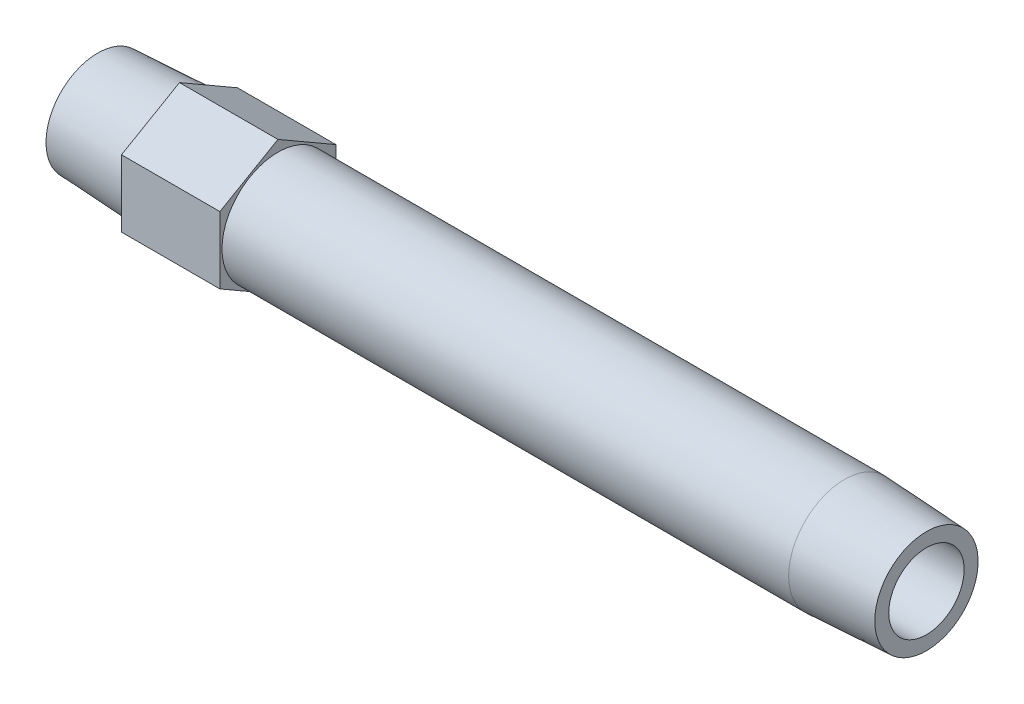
ISO-10303-21;
HEADER;
FILE_DESCRIPTION(('STEP AP214'),'2;1');
FILE_NAME('part.step','',(''),(''),'','','');
FILE_SCHEMA(('AUTOMOTIVE_DESIGN { 1 0 10303 214 1 1 1 1 }'));
ENDSEC;
DATA;
#1=APPLICATION_CONTEXT('core data for automotive mechanical design processes');
#2=APPLICATION_PROTOCOL_DEFINITION('international standard','automotive_design',2000,#1);
#3=PRODUCT_CONTEXT('',#1,'mechanical');
#4=PRODUCT('Part','Part','',(#3));
#5=PRODUCT_RELATED_PRODUCT_CATEGORY('part','',(#4));
#6=PRODUCT_DEFINITION_FORMATION('','',#4);
#7=PRODUCT_DEFINITION_CONTEXT('part definition',#1,'design');
#8=PRODUCT_DEFINITION('design','',#6,#7);
#9=PRODUCT_DEFINITION_SHAPE('','',#8);
#10=(LENGTH_UNIT() NAMED_UNIT(*) SI_UNIT(.MILLI.,.METRE.));
#11=(NAMED_UNIT(*) PLANE_ANGLE_UNIT() SI_UNIT($,.RADIAN.));
#12=(NAMED_UNIT(*) SI_UNIT($,.STERADIAN.) SOLID_ANGLE_UNIT());
#13=UNCERTAINTY_MEASURE_WITH_UNIT(LENGTH_MEASURE(1.E-05),#10,'distance_accuracy_value','');
#14=(GEOMETRIC_REPRESENTATION_CONTEXT(3) GLOBAL_UNCERTAINTY_ASSIGNED_CONTEXT((#13)) GLOBAL_UNIT_ASSIGNED_CONTEXT((#10,
#11,#12)) REPRESENTATION_CONTEXT('',''));
#15=CARTESIAN_POINT('',(0.,0.,0.));
#16=DIRECTION('',(0.,0.,1.));
#17=DIRECTION('',(1.,0.,0.));
#18=AXIS2_PLACEMENT_3D('',#15,#16,#17);
#19=CARTESIAN_POINT('',(0.,0.,-6.3321927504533));
#20=DIRECTION('',(1.,0.,0.));
#21=DIRECTION('',(0.,0.,-1.));
#22=AXIS2_PLACEMENT_3D('',#19,#20,#21);
#23=PLANE('',#22);
#24=CARTESIAN_POINT('',(0.,0.,0.));
#25=DIRECTION('',(-1.,0.,0.));
#26=DIRECTION('',(0.,0.,1.));
#27=AXIS2_PLACEMENT_3D('',#24,#25,#26);
#28=CIRCLE('',#27,6.3321927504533);
#29=CARTESIAN_POINT('',(0.,0.,6.3321927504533));
#30=VERTEX_POINT('',#29);
#31=EDGE_CURVE('E147',#30,#30,#28,.T.);
#32=ORIENTED_EDGE('',*,*,#31,.T.);
#33=EDGE_LOOP('',(#32));
#34=FACE_BOUND('',#33,.T.);
#35=CARTESIAN_POINT('',(0.,0.,0.));
#36=DIRECTION('',(1.,0.,0.));
#37=DIRECTION('',(0.,0.,1.));
#38=AXIS2_PLACEMENT_3D('',#35,#36,#37);
#39=CIRCLE('',#38,4.6228);
#40=CARTESIAN_POINT('',(0.,0.,4.6228));
#41=VERTEX_POINT('',#40);
#42=EDGE_CURVE('E159',#41,#41,#39,.T.);
#43=ORIENTED_EDGE('',*,*,#42,.T.);
#44=EDGE_LOOP('',(#43));
#45=FACE_BOUND('',#44,.T.);
#46=ADVANCED_FACE('F15',(#34,#45),#23,.F.);
#47=CARTESIAN_POINT('',(101.6,0.,-6.33219275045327));
#48=DIRECTION('',(-1.,0.,0.));
#49=DIRECTION('',(0.,0.,1.));
#50=AXIS2_PLACEMENT_3D('',#47,#48,#49);
#51=PLANE('',#50);
#52=CARTESIAN_POINT('',(101.6,0.,0.));
#53=DIRECTION('',(-1.,0.,0.));
#54=DIRECTION('',(0.,0.,1.));
#55=AXIS2_PLACEMENT_3D('',#52,#53,#54);
#56=CIRCLE('',#55,6.33219275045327);
#57=CARTESIAN_POINT('',(101.6,0.,6.33219275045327));
#58=VERTEX_POINT('',#57);
#59=EDGE_CURVE('E150',#58,#58,#56,.T.);
#60=ORIENTED_EDGE('',*,*,#59,.F.);
#61=EDGE_LOOP('',(#60));
#62=FACE_BOUND('',#61,.T.);
#63=CARTESIAN_POINT('',(101.6,0.,0.));
#64=DIRECTION('',(-1.,0.,0.));
#65=DIRECTION('',(0.,0.,1.));
#66=AXIS2_PLACEMENT_3D('',#63,#64,#65);
#67=CIRCLE('',#66,4.6228);
#68=CARTESIAN_POINT('',(101.6,0.,4.6228));
#69=VERTEX_POINT('',#68);
#70=EDGE_CURVE('E156',#69,#69,#67,.F.);
#71=ORIENTED_EDGE('',*,*,#70,.F.);
#72=EDGE_LOOP('',(#71));
#73=FACE_BOUND('',#72,.T.);
#74=ADVANCED_FACE('F178',(#62,#73),#51,.F.);
#75=CARTESIAN_POINT('',(22.098,-12.3183453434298,7.112));
#76=DIRECTION('',(-1.,0.,0.));
#77=DIRECTION('',(0.,-1.,0.));
#78=AXIS2_PLACEMENT_3D('',#75,#76,#77);
#79=PLANE('',#78);
#80=DIRECTION('',(0.,0.5,-0.866025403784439));
#81=VECTOR('',#80,1.);
#82=CARTESIAN_POINT('',(22.098,-8.21223022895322,0.));
#83=LINE('',#82,#81);
#84=CARTESIAN_POINT('',(22.098,-8.21223022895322,0.));
#85=VERTEX_POINT('',#84);
#86=CARTESIAN_POINT('',(22.098,-4.10611511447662,-7.112));
#87=VERTEX_POINT('',#86);
#88=EDGE_CURVE('E103',#85,#87,#83,.T.);
#89=ORIENTED_EDGE('',*,*,#88,.T.);
#90=DIRECTION('',(0.,1.,0.));
#91=VECTOR('',#90,1.);
#92=CARTESIAN_POINT('',(22.098,-4.10611511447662,-7.112));
#93=LINE('',#92,#91);
#94=CARTESIAN_POINT('',(22.098,4.10611511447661,-7.112));
#95=VERTEX_POINT('',#94);
#96=EDGE_CURVE('E83',#87,#95,#93,.T.);
#97=ORIENTED_EDGE('',*,*,#96,.T.);
#98=DIRECTION('',(0.,0.5,0.866025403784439));
#99=VECTOR('',#98,1.);
#100=CARTESIAN_POINT('',(22.098,4.10611511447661,-7.112));
#101=LINE('',#100,#99);
#102=CARTESIAN_POINT('',(22.098,8.21223022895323,0.));
#103=VERTEX_POINT('',#102);
#104=EDGE_CURVE('E102',#95,#103,#101,.T.);
#105=ORIENTED_EDGE('',*,*,#104,.T.);
#106=DIRECTION('',(0.,-0.5,0.866025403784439));
#107=VECTOR('',#106,1.);
#108=CARTESIAN_POINT('',(22.098,8.21223022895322,0.));
#109=LINE('',#108,#107);
#110=CARTESIAN_POINT('',(22.098,4.10611511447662,7.112));
#111=VERTEX_POINT('',#110);
#112=EDGE_CURVE('E105',#103,#111,#109,.T.);
#113=ORIENTED_EDGE('',*,*,#112,.T.);
#114=DIRECTION('',(0.,-1.,0.));
#115=VECTOR('',#114,1.);
#116=CARTESIAN_POINT('',(22.098,4.10611511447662,7.112));
#117=LINE('',#116,#115);
#118=CARTESIAN_POINT('',(22.098,-4.10611511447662,7.112));
#119=VERTEX_POINT('',#118);
#120=EDGE_CURVE('E35',#111,#119,#117,.T.);
#121=ORIENTED_EDGE('',*,*,#120,.T.);
#122=DIRECTION('',(0.,-0.5,-0.866025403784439));
#123=VECTOR('',#122,1.);
#124=CARTESIAN_POINT('',(22.098,-4.10611511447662,7.112));
#125=LINE('',#124,#123);
#126=EDGE_CURVE('E30',#119,#85,#125,.T.);
#127=ORIENTED_EDGE('',*,*,#126,.T.);
#128=EDGE_LOOP('',(#89,#97,#105,#113,#121,#127));
#129=FACE_BOUND('',#128,.T.);
#130=CARTESIAN_POINT('',(22.098,0.,0.));
#131=DIRECTION('',(-1.,0.,0.));
#132=DIRECTION('',(0.,-1.,0.));
#133=AXIS2_PLACEMENT_3D('',#130,#131,#132);
#134=CIRCLE('',#133,6.858);
#135=CARTESIAN_POINT('',(22.098,-6.858,0.));
#136=VERTEX_POINT('',#135);
#137=EDGE_CURVE('E89',#136,#136,#134,.F.);
#138=ORIENTED_EDGE('',*,*,#137,.F.);
#139=EDGE_LOOP('',(#138));
#140=FACE_BOUND('',#139,.T.);
#141=ADVANCED_FACE('F124',(#129,#140),#79,.F.);
#142=CARTESIAN_POINT('',(10.033,-12.3183453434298,7.112));
#143=DIRECTION('',(-1.,0.,0.));
#144=DIRECTION('',(0.,-1.,0.));
#145=AXIS2_PLACEMENT_3D('',#142,#143,#144);
#146=PLANE('',#145);
#147=DIRECTION('',(0.,0.5,-0.866025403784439));
#148=VECTOR('',#147,1.);
#149=CARTESIAN_POINT('',(10.033,-8.21223022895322,0.));
#150=LINE('',#149,#148);
#151=CARTESIAN_POINT('',(10.033,-8.21223022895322,0.));
#152=VERTEX_POINT('',#151);
#153=CARTESIAN_POINT('',(10.033,-4.10611511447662,-7.112));
#154=VERTEX_POINT('',#153);
#155=EDGE_CURVE('E73',#152,#154,#150,.T.);
#156=ORIENTED_EDGE('',*,*,#155,.F.);
#157=DIRECTION('',(0.,-0.5,-0.866025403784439));
#158=VECTOR('',#157,1.);
#159=CARTESIAN_POINT('',(10.033,-4.10611511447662,7.112));
#160=LINE('',#159,#158);
#161=CARTESIAN_POINT('',(10.033,-4.10611511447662,7.112));
#162=VERTEX_POINT('',#161);
#163=EDGE_CURVE('E99',#162,#152,#160,.T.);
#164=ORIENTED_EDGE('',*,*,#163,.F.);
#165=DIRECTION('',(0.,-1.,0.));
#166=VECTOR('',#165,1.);
#167=CARTESIAN_POINT('',(10.033,4.10611511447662,7.112));
#168=LINE('',#167,#166);
#169=CARTESIAN_POINT('',(10.033,4.10611511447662,7.112));
#170=VERTEX_POINT('',#169);
#171=EDGE_CURVE('E133',#170,#162,#168,.T.);
#172=ORIENTED_EDGE('',*,*,#171,.F.);
#173=DIRECTION('',(0.,-0.5,0.866025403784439));
#174=VECTOR('',#173,1.);
#175=CARTESIAN_POINT('',(10.033,8.21223022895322,0.));
#176=LINE('',#175,#174);
#177=CARTESIAN_POINT('',(10.033,8.21223022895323,0.));
#178=VERTEX_POINT('',#177);
#179=EDGE_CURVE('E129',#178,#170,#176,.T.);
#180=ORIENTED_EDGE('',*,*,#179,.F.);
#181=DIRECTION('',(0.,0.5,0.866025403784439));
#182=VECTOR('',#181,1.);
#183=CARTESIAN_POINT('',(10.033,4.10611511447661,-7.112));
#184=LINE('',#183,#182);
#185=CARTESIAN_POINT('',(10.033,4.10611511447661,-7.112));
#186=VERTEX_POINT('',#185);
#187=EDGE_CURVE('E75',#186,#178,#184,.T.);
#188=ORIENTED_EDGE('',*,*,#187,.F.);
#189=DIRECTION('',(0.,1.,0.));
#190=VECTOR('',#189,1.);
#191=CARTESIAN_POINT('',(10.033,-4.10611511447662,-7.112));
#192=LINE('',#191,#190);
#193=EDGE_CURVE('E68',#154,#186,#192,.T.);
#194=ORIENTED_EDGE('',*,*,#193,.F.);
#195=EDGE_LOOP('',(#156,#164,#172,#180,#188,#194));
#196=FACE_BOUND('',#195,.T.);
#197=CARTESIAN_POINT('',(10.033,0.,0.));
#198=DIRECTION('',(-1.,0.,0.));
#199=DIRECTION('',(0.,0.,1.));
#200=AXIS2_PLACEMENT_3D('',#197,#198,#199);
#201=CIRCLE('',#200,6.858);
#202=CARTESIAN_POINT('',(10.033,0.,6.858));
#203=VERTEX_POINT('',#202);
#204=EDGE_CURVE('E95',#203,#203,#201,.T.);
#205=ORIENTED_EDGE('',*,*,#204,.F.);
#206=EDGE_LOOP('',(#205));
#207=FACE_BOUND('',#206,.T.);
#208=ADVANCED_FACE('F69',(#196,#207),#146,.T.);
#209=CARTESIAN_POINT('',(22.098,-8.21223022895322,0.));
#210=DIRECTION('',(0.,0.866025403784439,0.5));
#211=DIRECTION('',(0.,-0.5,0.866025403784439));
#212=AXIS2_PLACEMENT_3D('',#209,#210,#211);
#213=PLANE('',#212);
#214=ORIENTED_EDGE('',*,*,#155,.T.);
#215=DIRECTION('',(-1.,0.,0.));
#216=VECTOR('',#215,1.);
#217=CARTESIAN_POINT('',(22.098,-4.10611511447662,-7.112));
#218=LINE('',#217,#216);
#219=EDGE_CURVE('E10',#87,#154,#218,.T.);
#220=ORIENTED_EDGE('',*,*,#219,.F.);
#221=ORIENTED_EDGE('',*,*,#88,.F.);
#222=DIRECTION('',(-1.,0.,0.));
#223=VECTOR('',#222,1.);
#224=CARTESIAN_POINT('',(22.098,-8.21223022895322,0.));
#225=LINE('',#224,#223);
#226=EDGE_CURVE('E87',#85,#152,#225,.T.);
#227=ORIENTED_EDGE('',*,*,#226,.T.);
#228=EDGE_LOOP('',(#214,#220,#221,#227));
#229=FACE_BOUND('',#228,.T.);
#230=ADVANCED_FACE('F17',(#229),#213,.F.);
#231=CARTESIAN_POINT('',(22.098,-4.10611511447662,-7.112));
#232=DIRECTION('',(0.,0.,1.));
#233=DIRECTION('',(0.,-1.,0.));
#234=AXIS2_PLACEMENT_3D('',#231,#232,#233);
#235=PLANE('',#234);
#236=ORIENTED_EDGE('',*,*,#193,.T.);
#237=DIRECTION('',(-1.,0.,0.));
#238=VECTOR('',#237,1.);
#239=CARTESIAN_POINT('',(22.098,4.10611511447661,-7.112));
#240=LINE('',#239,#238);
#241=EDGE_CURVE('E23',#95,#186,#240,.T.);
#242=ORIENTED_EDGE('',*,*,#241,.F.);
#243=ORIENTED_EDGE('',*,*,#96,.F.);
#244=ORIENTED_EDGE('',*,*,#219,.T.);
#245=EDGE_LOOP('',(#236,#242,#243,#244));
#246=FACE_BOUND('',#245,.T.);
#247=ADVANCED_FACE('F82',(#246),#235,.F.);
#248=CARTESIAN_POINT('',(22.098,4.10611511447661,-7.112));
#249=DIRECTION('',(0.,-0.866025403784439,0.5));
#250=DIRECTION('',(0.,-0.5,-0.866025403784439));
#251=AXIS2_PLACEMENT_3D('',#248,#249,#250);
#252=PLANE('',#251);
#253=ORIENTED_EDGE('',*,*,#187,.T.);
#254=DIRECTION('',(-1.,0.,0.));
#255=VECTOR('',#254,1.);
#256=CARTESIAN_POINT('',(22.098,8.21223022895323,0.));
#257=LINE('',#256,#255);
#258=EDGE_CURVE('E117',#103,#178,#257,.T.);
#259=ORIENTED_EDGE('',*,*,#258,.F.);
#260=ORIENTED_EDGE('',*,*,#104,.F.);
#261=ORIENTED_EDGE('',*,*,#241,.T.);
#262=EDGE_LOOP('',(#253,#259,#260,#261));
#263=FACE_BOUND('',#262,.T.);
#264=ADVANCED_FACE('F121',(#263),#252,.F.);
#265=CARTESIAN_POINT('',(22.098,8.21223022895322,0.));
#266=DIRECTION('',(0.,-0.866025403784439,-0.5));
#267=DIRECTION('',(0.,0.5,-0.866025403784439));
#268=AXIS2_PLACEMENT_3D('',#265,#266,#267);
#269=PLANE('',#268);
#270=ORIENTED_EDGE('',*,*,#179,.T.);
#271=DIRECTION('',(-1.,0.,0.));
#272=VECTOR('',#271,1.);
#273=CARTESIAN_POINT('',(22.098,4.10611511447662,7.112));
#274=LINE('',#273,#272);
#275=EDGE_CURVE('E114',#111,#170,#274,.T.);
#276=ORIENTED_EDGE('',*,*,#275,.F.);
#277=ORIENTED_EDGE('',*,*,#112,.F.);
#278=ORIENTED_EDGE('',*,*,#258,.T.);
#279=EDGE_LOOP('',(#270,#276,#277,#278));
#280=FACE_BOUND('',#279,.T.);
#281=ADVANCED_FACE('F128',(#280),#269,.F.);
#282=CARTESIAN_POINT('',(22.098,4.10611511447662,7.112));
#283=DIRECTION('',(0.,0.,-1.));
#284=DIRECTION('',(-1.,0.,0.));
#285=AXIS2_PLACEMENT_3D('',#282,#283,#284);
#286=PLANE('',#285);
#287=ORIENTED_EDGE('',*,*,#171,.T.);
#288=DIRECTION('',(-1.,0.,0.));
#289=VECTOR('',#288,1.);
#290=CARTESIAN_POINT('',(22.098,-4.10611511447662,7.112));
#291=LINE('',#290,#289);
#292=EDGE_CURVE('E111',#119,#162,#291,.T.);
#293=ORIENTED_EDGE('',*,*,#292,.F.);
#294=ORIENTED_EDGE('',*,*,#120,.F.);
#295=ORIENTED_EDGE('',*,*,#275,.T.);
#296=EDGE_LOOP('',(#287,#293,#294,#295));
#297=FACE_BOUND('',#296,.T.);
#298=ADVANCED_FACE('F132',(#297),#286,.F.);
#299=CARTESIAN_POINT('',(22.098,-4.10611511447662,7.112));
#300=DIRECTION('',(0.,0.866025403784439,-0.5));
#301=DIRECTION('',(0.,0.5,0.866025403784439));
#302=AXIS2_PLACEMENT_3D('',#299,#300,#301);
#303=PLANE('',#302);
#304=ORIENTED_EDGE('',*,*,#163,.T.);
#305=ORIENTED_EDGE('',*,*,#226,.F.);
#306=ORIENTED_EDGE('',*,*,#126,.F.);
#307=ORIENTED_EDGE('',*,*,#292,.T.);
#308=EDGE_LOOP('',(#304,#305,#306,#307));
#309=FACE_BOUND('',#308,.T.);
#310=ADVANCED_FACE('F135',(#309),#303,.F.);
#311=CARTESIAN_POINT('',(10.033,0.,0.));
#312=DIRECTION('',(1.,0.,0.));
#313=DIRECTION('',(0.,0.,-1.));
#314=AXIS2_PLACEMENT_3D('',#311,#312,#313);
#315=CONICAL_SURFACE('',#314,6.858,0.0523598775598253);
#316=ORIENTED_EDGE('',*,*,#31,.F.);
#317=EDGE_LOOP('',(#316));
#318=FACE_BOUND('',#317,.T.);
#319=ORIENTED_EDGE('',*,*,#204,.T.);
#320=EDGE_LOOP('',(#319));
#321=FACE_BOUND('',#320,.T.);
#322=ADVANCED_FACE('F187',(#318,#321),#315,.T.);
#323=CARTESIAN_POINT('',(-60.,0.,0.));
#324=DIRECTION('',(-1.,0.,0.));
#325=DIRECTION('',(0.,0.,1.));
#326=AXIS2_PLACEMENT_3D('',#323,#324,#325);
#327=CYLINDRICAL_SURFACE('',#326,6.858);
#328=ORIENTED_EDGE('',*,*,#137,.T.);
#329=EDGE_LOOP('',(#328));
#330=FACE_BOUND('',#329,.T.);
#331=CARTESIAN_POINT('',(91.567,0.,0.));
#332=DIRECTION('',(-1.,0.,0.));
#333=DIRECTION('',(0.,0.,1.));
#334=AXIS2_PLACEMENT_3D('',#331,#332,#333);
#335=CIRCLE('',#334,6.858);
#336=CARTESIAN_POINT('',(91.567,0.,6.858));
#337=VERTEX_POINT('',#336);
#338=EDGE_CURVE('E153',#337,#337,#335,.T.);
#339=ORIENTED_EDGE('',*,*,#338,.T.);
#340=EDGE_LOOP('',(#339));
#341=FACE_BOUND('',#340,.T.);
#342=ADVANCED_FACE('F174',(#330,#341),#327,.T.);
#343=CARTESIAN_POINT('',(101.6,0.,0.));
#344=DIRECTION('',(-1.,0.,0.));
#345=DIRECTION('',(0.,0.,1.));
#346=AXIS2_PLACEMENT_3D('',#343,#344,#345);
#347=CONICAL_SURFACE('',#346,6.33219275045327,0.0523598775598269);
#348=ORIENTED_EDGE('',*,*,#338,.F.);
#349=EDGE_LOOP('',(#348));
#350=FACE_BOUND('',#349,.T.);
#351=ORIENTED_EDGE('',*,*,#59,.T.);
#352=EDGE_LOOP('',(#351));
#353=FACE_BOUND('',#352,.T.);
#354=ADVANCED_FACE('F167',(#350,#353),#347,.T.);
#355=CARTESIAN_POINT('',(103.897281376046,0.,0.));
#356=DIRECTION('',(-1.,0.,0.));
#357=DIRECTION('',(0.,0.,1.));
#358=AXIS2_PLACEMENT_3D('',#355,#356,#357);
#359=CYLINDRICAL_SURFACE('',#358,4.6228);
#360=ORIENTED_EDGE('',*,*,#70,.T.);
#361=EDGE_LOOP('',(#360));
#362=FACE_BOUND('',#361,.T.);
#363=ORIENTED_EDGE('',*,*,#42,.F.);
#364=EDGE_LOOP('',(#363));
#365=FACE_BOUND('',#364,.T.);
#366=ADVANCED_FACE('F165',(#362,#365),#359,.F.);
#367=CLOSED_SHELL('',(#46,#74,#141,#208,#230,#247,#264,#281,#298,#310,#322,#342,#354,#366));
#368=MANIFOLD_SOLID_BREP('B1',#367);
#369=ADVANCED_BREP_SHAPE_REPRESENTATION('',(#18,#368),#14);
#370=SHAPE_DEFINITION_REPRESENTATION(#9,#369);
ENDSEC;
END-ISO-10303-21;
